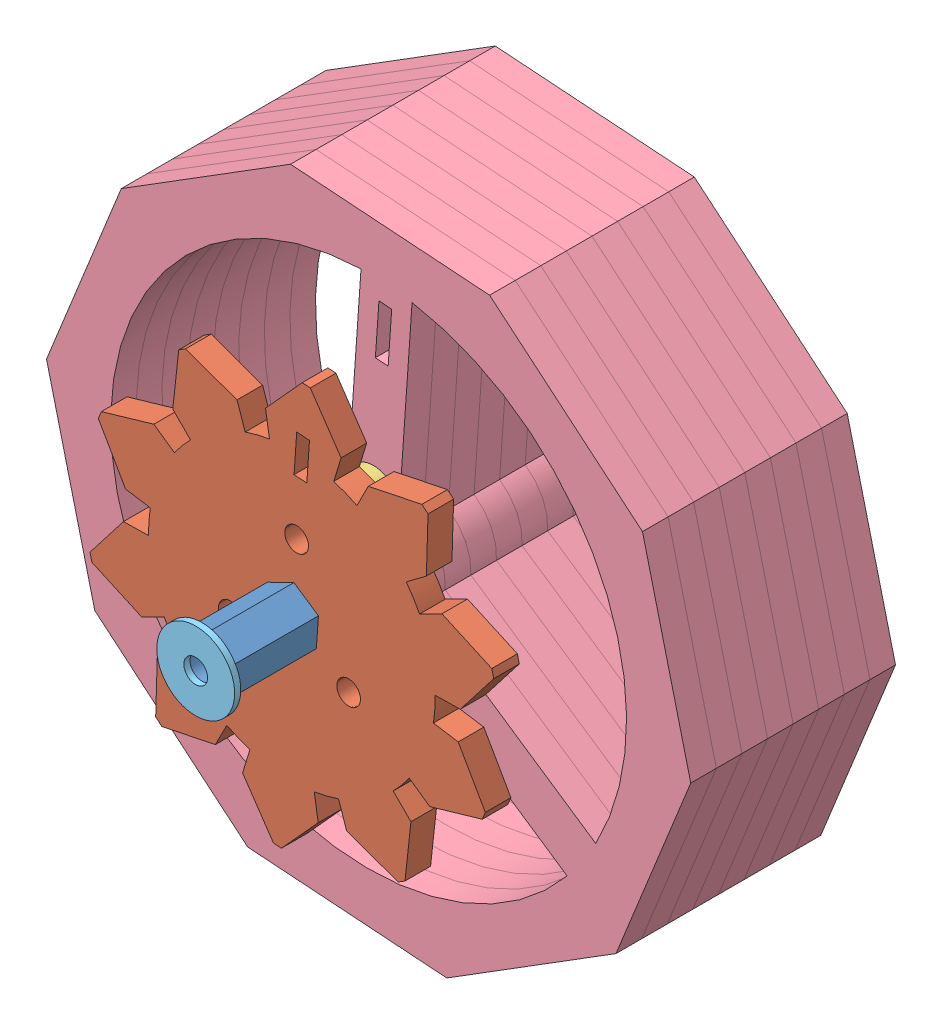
SolidWorks assembly Readout.SLDASM, configuration Default (file format 7000). Lengths in mm.
Overall size (85.24 81.6 65.02).
17 component instances, 6 part files, 30 mates.
Components (placement in the parent):
- Standoff-2p5in-1s4-3: Standoff-2p5in-1s4.SLDPRT [Default] at (-51.5451 71.035 -5.9896) x (0.829038 -0.559193 0) z (-0.559193 -0.829038 0) size (7.33 63.5 6.35)
- ReadoutGear-1: ReadoutGear.SLDPRT [Default] at (-51.5451 71.035 43.1699) x (0.997564 -0.069756 0) z (0 0 1) size (49.17 51.37 3.17)
- Spacer-0p25-1s4-4: Spacer-0p25-1s4.SLDPRT [Default] at (-59.1849 67.3088 36.8199) size (6.35 6.35 6.35)
- Spacer-0p25-1s4-5: Spacer-0p25-1s4.SLDPRT [Default] at (-44.4983 66.2819 36.8199) size (6.35 6.35 6.35)
- Spacer-0p25-1s4-6: Spacer-0p25-1s4.SLDPRT [Default] at (-50.9522 79.5143 36.8199) size (6.35 6.35 6.35)
- ReadoutCylinder-1: ReadoutCylinder.SLDPRT [Default] at (-51.5451 71.035 33.6449) x (0.997564 -0.069756 0) z (0 0 1) size (80.12 76.2 3.17)
- ReadoutCylinder-2: ReadoutCylinder.SLDPRT [Default] at (-51.5451 71.035 30.4699) x (0.997564 -0.069756 0) z (0 0 1) size (80.12 76.2 3.17)
- ReadoutCylinder-3: ReadoutCylinder.SLDPRT [Default] at (-51.5451 71.035 27.2949) x (0.997564 -0.069756 0) z (0 0 1) size (80.12 76.2 3.17)
- ReadoutCylinder-4: ReadoutCylinder.SLDPRT [Default] at (-51.5451 71.035 24.1199) x (0.997564 -0.069756 0) z (0 0 1) size (80.12 76.2 3.17)
- ReadoutCylinder-5: ReadoutCylinder.SLDPRT [Default] at (-51.5451 71.035 20.9449) x (0.997564 -0.069756 0) z (0 0 1) size (80.12 76.2 3.17)
- ReadoutCylinder-6: ReadoutCylinder.SLDPRT [Default] at (-51.5451 71.035 17.7699) x (0.997564 -0.069756 0) z (0 0 1) size (80.12 76.2 3.17)
- ReadoutCylinder-7: ReadoutCylinder.SLDPRT [Default] at (-51.5451 71.035 14.5949) x (0.997564 -0.069756 0) z (0 0 1) size (80.12 76.2 3.17)
- ReadoutCylinder-8: ReadoutCylinder.SLDPRT [Default] at (-51.5451 71.035 11.4199) x (0.997564 -0.069756 0) z (0 0 1) size (80.12 76.2 3.17)
- Washer-0p38in-1: Washer-0p38in.SLDPRT [Default] at (-51.5451 71.035 57.5104) x (0.999237 0.039047 0) z (0 0 1) size (9.65 9.65 0.76)
- Washer-0p38in-2: Washer-0p38in.SLDPRT [Default] at (-51.5451 71.035 -6.7516) size (9.65 9.65 0.76)
- Spacer-hex-1s4-1: Spacer-hex-1s4.SLDPRT [Default] at (-51.5451 71.035 7.2838) x (0.829038 -0.559193 0) z (0 0 1) size (13.2 11.43 3.17)
- Spacer-hex-1s4-2: Spacer-hex-1s4.SLDPRT [Default] at (-51.5451 71.035 4.1088) x (0.829038 -0.559193 0) z (0 0 1) size (13.2 11.43 3.17)
Mates (geometry in assembly coordinates):
- Coincident2: coincident anti-aligned: plane of ReadoutGear-1 through (-54.5845 73.0851 46.3449) normal (0.997564 -0.069756 0); plane of Standoff-2p5in-1s4-3 through (-54.5845 73.0851 57.5104) normal (-0.997564 0.069756 0)
- Coincident3: coincident anti-aligned: plane of ReadoutGear-1 through (-54.8403 69.4279 46.3449) normal (0.559193 0.829038 0); plane of Standoff-2p5in-1s4-3 through (-54.8403 69.4279 57.5104) normal (-0.559193 -0.829038 0)
- Coincident10: coincident anti-aligned: plane of ReadoutCylinder-2 through (-48.5057 68.9849 33.6449) normal (-0.997564 0.069756 0); plane of Standoff-2p5in-1s4-3 through (-48.5057 68.9849 57.5104) normal (0.997564 -0.069756 0)
- Coincident11: coincident anti-aligned: plane of ReadoutCylinder-2 through (-48.25 72.6421 33.6449) normal (-0.559193 -0.829038 0); plane of Standoff-2p5in-1s4-3 through (-48.25 72.6421 57.5104) normal (0.559193 0.829038 0)
- Coincident12: coincident aligned: circle of ReadoutCylinder-1; circle of ReadoutCylinder-2
- Coincident13: coincident aligned: circle of ReadoutCylinder-2; circle of ReadoutCylinder-3
- Coincident14: coincident aligned: circle of ReadoutCylinder-2; circle of ReadoutCylinder-3
- Coincident15: coincident aligned: circle of ReadoutCylinder-3; circle of ReadoutCylinder-4
- Coincident17: coincident aligned: circle of ReadoutCylinder-3; circle of ReadoutCylinder-4
- Coincident18: coincident aligned: circle of ReadoutCylinder-1; circle of Spacer-0p25-1s4-5
- Coincident19: coincident aligned: circle of ReadoutCylinder-1; circle of Spacer-0p25-1s4-6
- Coincident20: coincident aligned: circle of ReadoutCylinder-1; circle of Spacer-0p25-1s4-4
- Coincident21: coincident aligned: circle of ReadoutGear-1; circle of Spacer-0p25-1s4-6
- Coincident22: coincident aligned: circle of ReadoutGear-1; circle of Spacer-0p25-1s4-5
- Coincident29: coincident aligned: circle of ReadoutCylinder-7; circle of ReadoutCylinder-8
- Coincident30: coincident aligned: circle of ReadoutCylinder-7; circle of ReadoutCylinder-8
- Coincident31: coincident aligned: circle of ReadoutCylinder-6; circle of ReadoutCylinder-7
- Coincident32: coincident aligned: circle of ReadoutCylinder-6; circle of ReadoutCylinder-7
- Coincident33: coincident aligned: circle of ReadoutCylinder-5; circle of ReadoutCylinder-6
- Coincident34: coincident aligned: circle of ReadoutCylinder-5; circle of ReadoutCylinder-6
- Coincident35: coincident aligned: circle of ReadoutCylinder-4; circle of ReadoutCylinder-5
- Coincident36: coincident aligned: circle of ReadoutCylinder-4; circle of ReadoutCylinder-5
- Concentric1: concentric aligned: circle of Standoff-2p5in-1s4-3; circle of Washer-0p38in-1
- Coincident37: coincident anti-aligned: plane of Standoff-2p5in-1s4-3 through (-51.5451 71.035 57.5104) normal (0 0 1); plane of Washer-0p38in-1 through (-51.5451 71.035 57.5104) normal (0 0 -1)
- Concentric2: concentric aligned: circle of Standoff-2p5in-1s4-3; circle of Washer-0p38in-2
- Coincident38: coincident anti-aligned: plane of Standoff-2p5in-1s4-3 through (-51.5451 71.035 -5.9896) normal (0 0 -1); plane of Washer-0p38in-2 through (-51.5451 71.035 -5.9896) normal (0 0 1)
- Coincident39: coincident aligned: line of Spacer-hex-1s4-1 through (-45.6139 73.9279 10.4588) axis (0 0 -1); line of Spacer-hex-1s4-2 through (-45.6139 73.9279 7.2838) axis (0 0 -1)
- Coincident40: coincident aligned: line of Spacer-hex-1s4-1 through (-54.8403 69.4279 7.2838) axis (0.829038 -0.559193 0); line of Spacer-hex-1s4-2 through (-54.8403 69.4279 7.2838) axis (0.829038 -0.559193 0)
- Coincident41: coincident anti-aligned: plane of Standoff-2p5in-1s4-3 through (-48.25 72.6421 57.5104) normal (0.559193 0.829038 0); plane of Spacer-hex-1s4-2 through (-48.25 72.6421 7.2838) normal (-0.559193 -0.829038 0)
- Coincident42: coincident anti-aligned: plane of Standoff-2p5in-1s4-3 through (-48.5057 68.9849 57.5104) normal (0.997564 -0.069756 0); plane of Spacer-hex-1s4-2 through (-48.5057 68.9849 7.2838) normal (-0.997564 0.069756 0)
